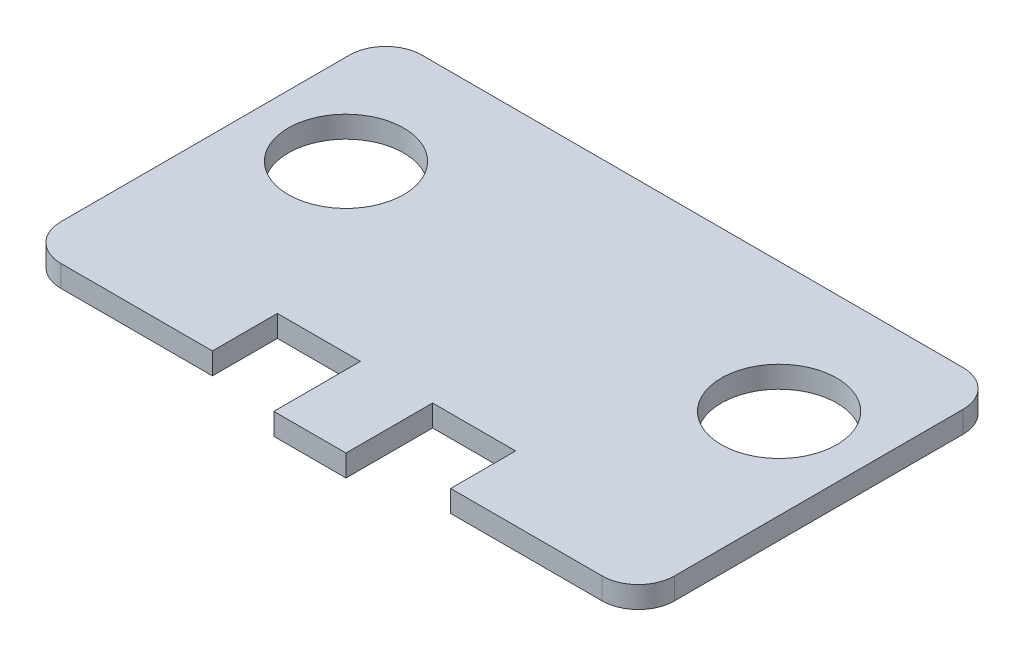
ISO-10303-21;
HEADER;
FILE_DESCRIPTION(('STEP AP214'),'2;1');
FILE_NAME('part.step','',(''),(''),'','','');
FILE_SCHEMA(('AUTOMOTIVE_DESIGN { 1 0 10303 214 1 1 1 1 }'));
ENDSEC;
DATA;
#1=APPLICATION_CONTEXT('core data for automotive mechanical design processes');
#2=APPLICATION_PROTOCOL_DEFINITION('international standard','automotive_design',2000,#1);
#3=PRODUCT_CONTEXT('',#1,'mechanical');
#4=PRODUCT('Part','Part','',(#3));
#5=PRODUCT_RELATED_PRODUCT_CATEGORY('part','',(#4));
#6=PRODUCT_DEFINITION_FORMATION('','',#4);
#7=PRODUCT_DEFINITION_CONTEXT('part definition',#1,'design');
#8=PRODUCT_DEFINITION('design','',#6,#7);
#9=PRODUCT_DEFINITION_SHAPE('','',#8);
#10=(LENGTH_UNIT() NAMED_UNIT(*) SI_UNIT(.MILLI.,.METRE.));
#11=(NAMED_UNIT(*) PLANE_ANGLE_UNIT() SI_UNIT($,.RADIAN.));
#12=(NAMED_UNIT(*) SI_UNIT($,.STERADIAN.) SOLID_ANGLE_UNIT());
#13=UNCERTAINTY_MEASURE_WITH_UNIT(LENGTH_MEASURE(1.E-05),#10,'distance_accuracy_value','');
#14=(GEOMETRIC_REPRESENTATION_CONTEXT(3) GLOBAL_UNCERTAINTY_ASSIGNED_CONTEXT((#13)) GLOBAL_UNIT_ASSIGNED_CONTEXT((#10,
#11,#12)) REPRESENTATION_CONTEXT('',''));
#15=CARTESIAN_POINT('',(0.,0.,0.));
#16=DIRECTION('',(0.,0.,1.));
#17=DIRECTION('',(1.,0.,0.));
#18=AXIS2_PLACEMENT_3D('',#15,#16,#17);
#19=CARTESIAN_POINT('',(0.,0.,16.));
#20=DIRECTION('',(0.,0.,-1.));
#21=DIRECTION('',(-1.,0.,0.));
#22=AXIS2_PLACEMENT_3D('',#19,#20,#21);
#23=PLANE('',#22);
#24=DIRECTION('',(0.,1.,0.));
#25=VECTOR('',#24,1.);
#26=CARTESIAN_POINT('',(5.,0.,16.));
#27=LINE('',#26,#25);
#28=CARTESIAN_POINT('',(5.,0.,16.));
#29=VERTEX_POINT('',#28);
#30=CARTESIAN_POINT('',(5.,3.,16.));
#31=VERTEX_POINT('',#30);
#32=EDGE_CURVE('E55',#29,#31,#27,.T.);
#33=ORIENTED_EDGE('',*,*,#32,.F.);
#34=DIRECTION('',(-1.,0.,0.));
#35=VECTOR('',#34,1.);
#36=CARTESIAN_POINT('',(0.,0.,16.));
#37=LINE('',#36,#35);
#38=CARTESIAN_POINT('',(16.5,0.,16.));
#39=VERTEX_POINT('',#38);
#40=EDGE_CURVE('E154',#39,#29,#37,.T.);
#41=ORIENTED_EDGE('',*,*,#40,.F.);
#42=DIRECTION('',(0.,1.,0.));
#43=VECTOR('',#42,1.);
#44=CARTESIAN_POINT('',(16.5,0.,16.));
#45=LINE('',#44,#43);
#46=CARTESIAN_POINT('',(16.5,3.,16.));
#47=VERTEX_POINT('',#46);
#48=EDGE_CURVE('E188',#39,#47,#45,.T.);
#49=ORIENTED_EDGE('',*,*,#48,.T.);
#50=DIRECTION('',(-1.,0.,0.));
#51=VECTOR('',#50,1.);
#52=CARTESIAN_POINT('',(0.,3.,16.));
#53=LINE('',#52,#51);
#54=EDGE_CURVE('E198',#47,#31,#53,.T.);
#55=ORIENTED_EDGE('',*,*,#54,.T.);
#56=EDGE_LOOP('',(#33,#41,#49,#55));
#57=FACE_BOUND('',#56,.T.);
#58=ADVANCED_FACE('F32',(#57),#23,.F.);
#59=CARTESIAN_POINT('',(-42.5,3.,25.));
#60=DIRECTION('',(0.,0.,-1.));
#61=DIRECTION('',(-1.,0.,0.));
#62=AXIS2_PLACEMENT_3D('',#59,#60,#61);
#63=PLANE('',#62);
#64=DIRECTION('',(0.,1.,0.));
#65=VECTOR('',#64,1.);
#66=CARTESIAN_POINT('',(16.5,0.,25.));
#67=LINE('',#66,#65);
#68=CARTESIAN_POINT('',(16.5,0.,25.));
#69=VERTEX_POINT('',#68);
#70=CARTESIAN_POINT('',(16.5,3.,25.));
#71=VERTEX_POINT('',#70);
#72=EDGE_CURVE('E185',#69,#71,#67,.T.);
#73=ORIENTED_EDGE('',*,*,#72,.F.);
#74=DIRECTION('',(1.,0.,0.));
#75=VECTOR('',#74,1.);
#76=CARTESIAN_POINT('',(-42.5,0.,25.));
#77=LINE('',#76,#75);
#78=CARTESIAN_POINT('',(37.5,0.,25.));
#79=VERTEX_POINT('',#78);
#80=EDGE_CURVE('E243',#69,#79,#77,.T.);
#81=ORIENTED_EDGE('',*,*,#80,.T.);
#82=DIRECTION('',(0.,-1.,0.));
#83=VECTOR('',#82,1.);
#84=CARTESIAN_POINT('',(37.5,3.,25.));
#85=LINE('',#84,#83);
#86=CARTESIAN_POINT('',(37.5,3.,25.));
#87=VERTEX_POINT('',#86);
#88=EDGE_CURVE('E11',#79,#87,#85,.F.);
#89=ORIENTED_EDGE('',*,*,#88,.T.);
#90=DIRECTION('',(1.,0.,0.));
#91=VECTOR('',#90,1.);
#92=CARTESIAN_POINT('',(-42.5,3.,25.));
#93=LINE('',#92,#91);
#94=EDGE_CURVE('E230',#71,#87,#93,.T.);
#95=ORIENTED_EDGE('',*,*,#94,.F.);
#96=EDGE_LOOP('',(#73,#81,#89,#95));
#97=FACE_BOUND('',#96,.T.);
#98=ADVANCED_FACE('F323',(#97),#63,.F.);
#99=CARTESIAN_POINT('',(0.,3.,0.));
#100=DIRECTION('',(0.,1.,0.));
#101=DIRECTION('',(0.,0.,1.));
#102=AXIS2_PLACEMENT_3D('',#99,#100,#101);
#103=PLANE('',#102);
#104=CARTESIAN_POINT('',(-30.,3.,-7.00000000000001));
#105=DIRECTION('',(0.,1.,0.));
#106=DIRECTION('',(0.,0.,1.));
#107=AXIS2_PLACEMENT_3D('',#104,#105,#106);
#108=CIRCLE('',#107,8.);
#109=CARTESIAN_POINT('',(-30.,3.,0.999999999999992));
#110=VERTEX_POINT('',#109);
#111=EDGE_CURVE('E211',#110,#110,#108,.T.);
#112=ORIENTED_EDGE('',*,*,#111,.F.);
#113=EDGE_LOOP('',(#112));
#114=FACE_BOUND('',#113,.T.);
#115=CARTESIAN_POINT('',(30.,3.,-7.00000000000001));
#116=DIRECTION('',(0.,1.,0.));
#117=DIRECTION('',(0.,0.,1.));
#118=AXIS2_PLACEMENT_3D('',#115,#116,#117);
#119=CIRCLE('',#118,8.);
#120=CARTESIAN_POINT('',(30.,3.,0.999999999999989));
#121=VERTEX_POINT('',#120);
#122=EDGE_CURVE('E205',#121,#121,#119,.T.);
#123=ORIENTED_EDGE('',*,*,#122,.F.);
#124=EDGE_LOOP('',(#123));
#125=FACE_BOUND('',#124,.T.);
#126=ORIENTED_EDGE('',*,*,#54,.F.);
#127=DIRECTION('',(0.,0.,1.));
#128=VECTOR('',#127,1.);
#129=CARTESIAN_POINT('',(16.5,3.,25.));
#130=LINE('',#129,#128);
#131=EDGE_CURVE('E182',#47,#71,#130,.T.);
#132=ORIENTED_EDGE('',*,*,#131,.T.);
#133=ORIENTED_EDGE('',*,*,#94,.T.);
#134=CARTESIAN_POINT('',(37.5,3.,20.));
#135=DIRECTION('',(0.,1.,0.));
#136=DIRECTION('',(0.,0.,1.));
#137=AXIS2_PLACEMENT_3D('',#134,#135,#136);
#138=CIRCLE('',#137,5.);
#139=CARTESIAN_POINT('',(42.5,3.,20.));
#140=VERTEX_POINT('',#139);
#141=EDGE_CURVE('E266',#87,#140,#138,.T.);
#142=ORIENTED_EDGE('',*,*,#141,.T.);
#143=DIRECTION('',(0.,0.,-1.));
#144=VECTOR('',#143,1.);
#145=CARTESIAN_POINT('',(42.5,3.,-25.));
#146=LINE('',#145,#144);
#147=CARTESIAN_POINT('',(42.5,3.,-20.));
#148=VERTEX_POINT('',#147);
#149=EDGE_CURVE('E220',#140,#148,#146,.T.);
#150=ORIENTED_EDGE('',*,*,#149,.T.);
#151=CARTESIAN_POINT('',(37.5,3.,-20.));
#152=DIRECTION('',(0.,1.,0.));
#153=DIRECTION('',(0.,0.,1.));
#154=AXIS2_PLACEMENT_3D('',#151,#152,#153);
#155=CIRCLE('',#154,5.);
#156=CARTESIAN_POINT('',(37.5,3.,-25.));
#157=VERTEX_POINT('',#156);
#158=EDGE_CURVE('E268',#148,#157,#155,.T.);
#159=ORIENTED_EDGE('',*,*,#158,.T.);
#160=DIRECTION('',(-1.,0.,0.));
#161=VECTOR('',#160,1.);
#162=CARTESIAN_POINT('',(-42.5,3.,-25.));
#163=LINE('',#162,#161);
#164=CARTESIAN_POINT('',(-37.5,3.,-25.));
#165=VERTEX_POINT('',#164);
#166=EDGE_CURVE('E223',#157,#165,#163,.T.);
#167=ORIENTED_EDGE('',*,*,#166,.T.);
#168=CARTESIAN_POINT('',(-37.5,3.,-20.));
#169=DIRECTION('',(0.,1.,0.));
#170=DIRECTION('',(0.,0.,1.));
#171=AXIS2_PLACEMENT_3D('',#168,#169,#170);
#172=CIRCLE('',#171,5.);
#173=CARTESIAN_POINT('',(-42.5,3.,-20.));
#174=VERTEX_POINT('',#173);
#175=EDGE_CURVE('E270',#165,#174,#172,.T.);
#176=ORIENTED_EDGE('',*,*,#175,.T.);
#177=DIRECTION('',(0.,0.,1.));
#178=VECTOR('',#177,1.);
#179=CARTESIAN_POINT('',(-42.5,3.,-25.));
#180=LINE('',#179,#178);
#181=CARTESIAN_POINT('',(-42.5,3.,20.));
#182=VERTEX_POINT('',#181);
#183=EDGE_CURVE('E227',#174,#182,#180,.T.);
#184=ORIENTED_EDGE('',*,*,#183,.T.);
#185=CARTESIAN_POINT('',(-37.5,3.,20.));
#186=DIRECTION('',(0.,1.,0.));
#187=DIRECTION('',(0.,0.,1.));
#188=AXIS2_PLACEMENT_3D('',#185,#186,#187);
#189=CIRCLE('',#188,5.);
#190=CARTESIAN_POINT('',(-37.5,3.,25.));
#191=VERTEX_POINT('',#190);
#192=EDGE_CURVE('E264',#182,#191,#189,.T.);
#193=ORIENTED_EDGE('',*,*,#192,.T.);
#194=CARTESIAN_POINT('',(-16.5,3.,25.));
#195=VERTEX_POINT('',#194);
#196=EDGE_CURVE('E231',#191,#195,#93,.T.);
#197=ORIENTED_EDGE('',*,*,#196,.T.);
#198=DIRECTION('',(0.,0.,1.));
#199=VECTOR('',#198,1.);
#200=CARTESIAN_POINT('',(-16.5,3.,25.));
#201=LINE('',#200,#199);
#202=CARTESIAN_POINT('',(-16.5,3.,16.));
#203=VERTEX_POINT('',#202);
#204=EDGE_CURVE('E200',#203,#195,#201,.T.);
#205=ORIENTED_EDGE('',*,*,#204,.F.);
#206=CARTESIAN_POINT('',(-5.,3.,16.));
#207=VERTEX_POINT('',#206);
#208=EDGE_CURVE('E191',#207,#203,#53,.T.);
#209=ORIENTED_EDGE('',*,*,#208,.F.);
#210=DIRECTION('',(0.,0.,1.));
#211=VECTOR('',#210,1.);
#212=CARTESIAN_POINT('',(-5.,3.,16.));
#213=LINE('',#212,#211);
#214=CARTESIAN_POINT('',(-5.,3.,28.));
#215=VERTEX_POINT('',#214);
#216=EDGE_CURVE('E156',#207,#215,#213,.T.);
#217=ORIENTED_EDGE('',*,*,#216,.T.);
#218=DIRECTION('',(1.,0.,0.));
#219=VECTOR('',#218,1.);
#220=CARTESIAN_POINT('',(-5.,3.,28.));
#221=LINE('',#220,#219);
#222=CARTESIAN_POINT('',(5.,3.,28.));
#223=VERTEX_POINT('',#222);
#224=EDGE_CURVE('E175',#215,#223,#221,.T.);
#225=ORIENTED_EDGE('',*,*,#224,.T.);
#226=DIRECTION('',(0.,0.,1.));
#227=VECTOR('',#226,1.);
#228=CARTESIAN_POINT('',(5.,3.,16.));
#229=LINE('',#228,#227);
#230=EDGE_CURVE('E162',#31,#223,#229,.T.);
#231=ORIENTED_EDGE('',*,*,#230,.F.);
#232=EDGE_LOOP('',(#126,#132,#133,#142,#150,#159,#167,#176,#184,#193,#197,#205,#209,#217,#225,#231));
#233=FACE_BOUND('',#232,.T.);
#234=ADVANCED_FACE('F292',(#114,#125,#233),#103,.T.);
#235=CARTESIAN_POINT('',(0.,0.,0.));
#236=DIRECTION('',(0.,1.,0.));
#237=DIRECTION('',(0.,0.,1.));
#238=AXIS2_PLACEMENT_3D('',#235,#236,#237);
#239=PLANE('',#238);
#240=CARTESIAN_POINT('',(-30.,0.,-7.00000000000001));
#241=DIRECTION('',(0.,1.,0.));
#242=DIRECTION('',(0.,0.,1.));
#243=AXIS2_PLACEMENT_3D('',#240,#241,#242);
#244=CIRCLE('',#243,8.);
#245=CARTESIAN_POINT('',(-30.,0.,0.999999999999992));
#246=VERTEX_POINT('',#245);
#247=EDGE_CURVE('E214',#246,#246,#244,.T.);
#248=ORIENTED_EDGE('',*,*,#247,.T.);
#249=EDGE_LOOP('',(#248));
#250=FACE_BOUND('',#249,.T.);
#251=CARTESIAN_POINT('',(30.,0.,-7.00000000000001));
#252=DIRECTION('',(0.,1.,0.));
#253=DIRECTION('',(0.,0.,1.));
#254=AXIS2_PLACEMENT_3D('',#251,#252,#253);
#255=CIRCLE('',#254,8.);
#256=CARTESIAN_POINT('',(30.,0.,0.999999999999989));
#257=VERTEX_POINT('',#256);
#258=EDGE_CURVE('E208',#257,#257,#255,.T.);
#259=ORIENTED_EDGE('',*,*,#258,.T.);
#260=EDGE_LOOP('',(#259));
#261=FACE_BOUND('',#260,.T.);
#262=DIRECTION('',(0.,0.,1.));
#263=VECTOR('',#262,1.);
#264=CARTESIAN_POINT('',(16.5,0.,25.));
#265=LINE('',#264,#263);
#266=EDGE_CURVE('E183',#39,#69,#265,.T.);
#267=ORIENTED_EDGE('',*,*,#266,.F.);
#268=ORIENTED_EDGE('',*,*,#40,.T.);
#269=DIRECTION('',(0.,0.,1.));
#270=VECTOR('',#269,1.);
#271=CARTESIAN_POINT('',(5.,0.,16.));
#272=LINE('',#271,#270);
#273=CARTESIAN_POINT('',(5.,0.,28.));
#274=VERTEX_POINT('',#273);
#275=EDGE_CURVE('E146',#29,#274,#272,.T.);
#276=ORIENTED_EDGE('',*,*,#275,.T.);
#277=DIRECTION('',(1.,0.,0.));
#278=VECTOR('',#277,1.);
#279=CARTESIAN_POINT('',(-5.,0.,28.));
#280=LINE('',#279,#278);
#281=CARTESIAN_POINT('',(-5.,0.,28.));
#282=VERTEX_POINT('',#281);
#283=EDGE_CURVE('E152',#282,#274,#280,.T.);
#284=ORIENTED_EDGE('',*,*,#283,.F.);
#285=DIRECTION('',(0.,0.,1.));
#286=VECTOR('',#285,1.);
#287=CARTESIAN_POINT('',(-5.,0.,16.));
#288=LINE('',#287,#286);
#289=CARTESIAN_POINT('',(-5.,0.,16.));
#290=VERTEX_POINT('',#289);
#291=EDGE_CURVE('E169',#290,#282,#288,.T.);
#292=ORIENTED_EDGE('',*,*,#291,.F.);
#293=CARTESIAN_POINT('',(-16.5,0.,16.));
#294=VERTEX_POINT('',#293);
#295=EDGE_CURVE('E47',#290,#294,#37,.T.);
#296=ORIENTED_EDGE('',*,*,#295,.T.);
#297=DIRECTION('',(0.,0.,1.));
#298=VECTOR('',#297,1.);
#299=CARTESIAN_POINT('',(-16.5,0.,25.));
#300=LINE('',#299,#298);
#301=CARTESIAN_POINT('',(-16.5,0.,25.));
#302=VERTEX_POINT('',#301);
#303=EDGE_CURVE('E194',#294,#302,#300,.T.);
#304=ORIENTED_EDGE('',*,*,#303,.T.);
#305=CARTESIAN_POINT('',(-37.5,0.,25.));
#306=VERTEX_POINT('',#305);
#307=EDGE_CURVE('E224',#306,#302,#77,.T.);
#308=ORIENTED_EDGE('',*,*,#307,.F.);
#309=CARTESIAN_POINT('',(-37.5,0.,20.));
#310=DIRECTION('',(0.,1.,0.));
#311=DIRECTION('',(0.,0.,1.));
#312=AXIS2_PLACEMENT_3D('',#309,#310,#311);
#313=CIRCLE('',#312,5.);
#314=CARTESIAN_POINT('',(-42.5,0.,20.));
#315=VERTEX_POINT('',#314);
#316=EDGE_CURVE('E250',#306,#315,#313,.F.);
#317=ORIENTED_EDGE('',*,*,#316,.T.);
#318=DIRECTION('',(0.,0.,1.));
#319=VECTOR('',#318,1.);
#320=CARTESIAN_POINT('',(-42.5,0.,-25.));
#321=LINE('',#320,#319);
#322=CARTESIAN_POINT('',(-42.5,0.,-20.));
#323=VERTEX_POINT('',#322);
#324=EDGE_CURVE('E240',#323,#315,#321,.T.);
#325=ORIENTED_EDGE('',*,*,#324,.F.);
#326=CARTESIAN_POINT('',(-37.5,0.,-20.));
#327=DIRECTION('',(0.,1.,0.));
#328=DIRECTION('',(0.,0.,1.));
#329=AXIS2_PLACEMENT_3D('',#326,#327,#328);
#330=CIRCLE('',#329,5.);
#331=CARTESIAN_POINT('',(-37.5,0.,-25.));
#332=VERTEX_POINT('',#331);
#333=EDGE_CURVE('E257',#323,#332,#330,.F.);
#334=ORIENTED_EDGE('',*,*,#333,.T.);
#335=DIRECTION('',(-1.,0.,0.));
#336=VECTOR('',#335,1.);
#337=CARTESIAN_POINT('',(-42.5,0.,-25.));
#338=LINE('',#337,#336);
#339=CARTESIAN_POINT('',(37.5,0.,-25.));
#340=VERTEX_POINT('',#339);
#341=EDGE_CURVE('E237',#340,#332,#338,.T.);
#342=ORIENTED_EDGE('',*,*,#341,.F.);
#343=CARTESIAN_POINT('',(37.5,0.,-20.));
#344=DIRECTION('',(0.,1.,0.));
#345=DIRECTION('',(0.,0.,1.));
#346=AXIS2_PLACEMENT_3D('',#343,#344,#345);
#347=CIRCLE('',#346,5.);
#348=CARTESIAN_POINT('',(42.5,0.,-20.));
#349=VERTEX_POINT('',#348);
#350=EDGE_CURVE('E255',#340,#349,#347,.F.);
#351=ORIENTED_EDGE('',*,*,#350,.T.);
#352=DIRECTION('',(0.,0.,-1.));
#353=VECTOR('',#352,1.);
#354=CARTESIAN_POINT('',(42.5,0.,-25.));
#355=LINE('',#354,#353);
#356=CARTESIAN_POINT('',(42.5,0.,20.));
#357=VERTEX_POINT('',#356);
#358=EDGE_CURVE('E217',#357,#349,#355,.T.);
#359=ORIENTED_EDGE('',*,*,#358,.F.);
#360=CARTESIAN_POINT('',(37.5,0.,20.));
#361=DIRECTION('',(0.,1.,0.));
#362=DIRECTION('',(0.,0.,1.));
#363=AXIS2_PLACEMENT_3D('',#360,#361,#362);
#364=CIRCLE('',#363,5.);
#365=EDGE_CURVE('E252',#357,#79,#364,.F.);
#366=ORIENTED_EDGE('',*,*,#365,.T.);
#367=ORIENTED_EDGE('',*,*,#80,.F.);
#368=EDGE_LOOP('',(#267,#268,#276,#284,#292,#296,#304,#308,#317,#325,#334,#342,#351,#359,#366,#367));
#369=FACE_BOUND('',#368,.T.);
#370=ADVANCED_FACE('F149',(#250,#261,#369),#239,.F.);
#371=CARTESIAN_POINT('',(42.5,3.,-25.));
#372=DIRECTION('',(-1.,0.,0.));
#373=DIRECTION('',(0.,0.,1.));
#374=AXIS2_PLACEMENT_3D('',#371,#372,#373);
#375=PLANE('',#374);
#376=ORIENTED_EDGE('',*,*,#358,.T.);
#377=DIRECTION('',(0.,-1.,0.));
#378=VECTOR('',#377,1.);
#379=CARTESIAN_POINT('',(42.5,3.,-20.));
#380=LINE('',#379,#378);
#381=EDGE_CURVE('E275',#349,#148,#380,.F.);
#382=ORIENTED_EDGE('',*,*,#381,.T.);
#383=ORIENTED_EDGE('',*,*,#149,.F.);
#384=DIRECTION('',(0.,-1.,0.));
#385=VECTOR('',#384,1.);
#386=CARTESIAN_POINT('',(42.5,3.,20.));
#387=LINE('',#386,#385);
#388=EDGE_CURVE('E272',#140,#357,#387,.T.);
#389=ORIENTED_EDGE('',*,*,#388,.T.);
#390=EDGE_LOOP('',(#376,#382,#383,#389));
#391=FACE_BOUND('',#390,.T.);
#392=ADVANCED_FACE('F313',(#391),#375,.F.);
#393=CARTESIAN_POINT('',(-42.5,3.,-25.));
#394=DIRECTION('',(0.,0.,1.));
#395=DIRECTION('',(1.,0.,0.));
#396=AXIS2_PLACEMENT_3D('',#393,#394,#395);
#397=PLANE('',#396);
#398=ORIENTED_EDGE('',*,*,#341,.T.);
#399=DIRECTION('',(0.,-1.,0.));
#400=VECTOR('',#399,1.);
#401=CARTESIAN_POINT('',(-37.5,3.,-25.));
#402=LINE('',#401,#400);
#403=EDGE_CURVE('E262',#332,#165,#402,.F.);
#404=ORIENTED_EDGE('',*,*,#403,.T.);
#405=ORIENTED_EDGE('',*,*,#166,.F.);
#406=DIRECTION('',(0.,-1.,0.));
#407=VECTOR('',#406,1.);
#408=CARTESIAN_POINT('',(37.5,3.,-25.));
#409=LINE('',#408,#407);
#410=EDGE_CURVE('E259',#157,#340,#409,.T.);
#411=ORIENTED_EDGE('',*,*,#410,.T.);
#412=EDGE_LOOP('',(#398,#404,#405,#411));
#413=FACE_BOUND('',#412,.T.);
#414=ADVANCED_FACE('F302',(#413),#397,.F.);
#415=CARTESIAN_POINT('',(-42.5,3.,-25.));
#416=DIRECTION('',(1.,0.,0.));
#417=DIRECTION('',(0.,0.,-1.));
#418=AXIS2_PLACEMENT_3D('',#415,#416,#417);
#419=PLANE('',#418);
#420=ORIENTED_EDGE('',*,*,#183,.F.);
#421=DIRECTION('',(0.,-1.,0.));
#422=VECTOR('',#421,1.);
#423=CARTESIAN_POINT('',(-42.5,3.,-20.));
#424=LINE('',#423,#422);
#425=EDGE_CURVE('E247',#174,#323,#424,.T.);
#426=ORIENTED_EDGE('',*,*,#425,.T.);
#427=ORIENTED_EDGE('',*,*,#324,.T.);
#428=DIRECTION('',(0.,-1.,0.));
#429=VECTOR('',#428,1.);
#430=CARTESIAN_POINT('',(-42.5,3.,20.));
#431=LINE('',#430,#429);
#432=EDGE_CURVE('E234',#315,#182,#431,.F.);
#433=ORIENTED_EDGE('',*,*,#432,.T.);
#434=EDGE_LOOP('',(#420,#426,#427,#433));
#435=FACE_BOUND('',#434,.T.);
#436=ADVANCED_FACE('F296',(#435),#419,.F.);
#437=ORIENTED_EDGE('',*,*,#307,.T.);
#438=DIRECTION('',(0.,1.,0.));
#439=VECTOR('',#438,1.);
#440=CARTESIAN_POINT('',(-16.5,0.,25.));
#441=LINE('',#440,#439);
#442=EDGE_CURVE('E202',#302,#195,#441,.T.);
#443=ORIENTED_EDGE('',*,*,#442,.T.);
#444=ORIENTED_EDGE('',*,*,#196,.F.);
#445=DIRECTION('',(0.,-1.,0.));
#446=VECTOR('',#445,1.);
#447=CARTESIAN_POINT('',(-37.5,3.,25.));
#448=LINE('',#447,#446);
#449=EDGE_CURVE('E40',#191,#306,#448,.T.);
#450=ORIENTED_EDGE('',*,*,#449,.T.);
#451=EDGE_LOOP('',(#437,#443,#444,#450));
#452=FACE_BOUND('',#451,.T.);
#453=ADVANCED_FACE('F281',(#452),#63,.F.);
#454=CARTESIAN_POINT('',(-37.5,3.,-20.));
#455=DIRECTION('',(0.,-1.,0.));
#456=DIRECTION('',(0.,0.,-1.));
#457=AXIS2_PLACEMENT_3D('',#454,#455,#456);
#458=CYLINDRICAL_SURFACE('',#457,5.);
#459=ORIENTED_EDGE('',*,*,#175,.F.);
#460=ORIENTED_EDGE('',*,*,#403,.F.);
#461=ORIENTED_EDGE('',*,*,#333,.F.);
#462=ORIENTED_EDGE('',*,*,#425,.F.);
#463=EDGE_LOOP('',(#459,#460,#461,#462));
#464=FACE_BOUND('',#463,.T.);
#465=ADVANCED_FACE('F306',(#464),#458,.T.);
#466=CARTESIAN_POINT('',(37.5,3.,-20.));
#467=DIRECTION('',(0.,-1.,0.));
#468=DIRECTION('',(0.,0.,-1.));
#469=AXIS2_PLACEMENT_3D('',#466,#467,#468);
#470=CYLINDRICAL_SURFACE('',#469,5.);
#471=ORIENTED_EDGE('',*,*,#158,.F.);
#472=ORIENTED_EDGE('',*,*,#381,.F.);
#473=ORIENTED_EDGE('',*,*,#350,.F.);
#474=ORIENTED_EDGE('',*,*,#410,.F.);
#475=EDGE_LOOP('',(#471,#472,#473,#474));
#476=FACE_BOUND('',#475,.T.);
#477=ADVANCED_FACE('F309',(#476),#470,.T.);
#478=CARTESIAN_POINT('',(37.5,3.,20.));
#479=DIRECTION('',(0.,-1.,0.));
#480=DIRECTION('',(0.,0.,-1.));
#481=AXIS2_PLACEMENT_3D('',#478,#479,#480);
#482=CYLINDRICAL_SURFACE('',#481,5.);
#483=ORIENTED_EDGE('',*,*,#141,.F.);
#484=ORIENTED_EDGE('',*,*,#88,.F.);
#485=ORIENTED_EDGE('',*,*,#365,.F.);
#486=ORIENTED_EDGE('',*,*,#388,.F.);
#487=EDGE_LOOP('',(#483,#484,#485,#486));
#488=FACE_BOUND('',#487,.T.);
#489=ADVANCED_FACE('F318',(#488),#482,.T.);
#490=CARTESIAN_POINT('',(-37.5,3.,20.));
#491=DIRECTION('',(0.,-1.,0.));
#492=DIRECTION('',(0.,0.,-1.));
#493=AXIS2_PLACEMENT_3D('',#490,#491,#492);
#494=CYLINDRICAL_SURFACE('',#493,5.);
#495=ORIENTED_EDGE('',*,*,#192,.F.);
#496=ORIENTED_EDGE('',*,*,#432,.F.);
#497=ORIENTED_EDGE('',*,*,#316,.F.);
#498=ORIENTED_EDGE('',*,*,#449,.F.);
#499=EDGE_LOOP('',(#495,#496,#497,#498));
#500=FACE_BOUND('',#499,.T.);
#501=ADVANCED_FACE('F34',(#500),#494,.T.);
#502=CARTESIAN_POINT('',(-30.,0.,-7.00000000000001));
#503=DIRECTION('',(0.,1.,0.));
#504=DIRECTION('',(0.,0.,1.));
#505=AXIS2_PLACEMENT_3D('',#502,#503,#504);
#506=CYLINDRICAL_SURFACE('',#505,8.);
#507=ORIENTED_EDGE('',*,*,#247,.F.);
#508=EDGE_LOOP('',(#507));
#509=FACE_BOUND('',#508,.T.);
#510=ORIENTED_EDGE('',*,*,#111,.T.);
#511=EDGE_LOOP('',(#510));
#512=FACE_BOUND('',#511,.T.);
#513=ADVANCED_FACE('F347',(#509,#512),#506,.F.);
#514=CARTESIAN_POINT('',(30.,0.,-7.00000000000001));
#515=DIRECTION('',(0.,1.,0.));
#516=DIRECTION('',(0.,0.,1.));
#517=AXIS2_PLACEMENT_3D('',#514,#515,#516);
#518=CYLINDRICAL_SURFACE('',#517,8.);
#519=ORIENTED_EDGE('',*,*,#258,.F.);
#520=EDGE_LOOP('',(#519));
#521=FACE_BOUND('',#520,.T.);
#522=ORIENTED_EDGE('',*,*,#122,.T.);
#523=EDGE_LOOP('',(#522));
#524=FACE_BOUND('',#523,.T.);
#525=ADVANCED_FACE('F343',(#521,#524),#518,.F.);
#526=CARTESIAN_POINT('',(-16.5,0.,25.));
#527=DIRECTION('',(-1.,0.,0.));
#528=DIRECTION('',(0.,0.,1.));
#529=AXIS2_PLACEMENT_3D('',#526,#527,#528);
#530=PLANE('',#529);
#531=ORIENTED_EDGE('',*,*,#204,.T.);
#532=ORIENTED_EDGE('',*,*,#442,.F.);
#533=ORIENTED_EDGE('',*,*,#303,.F.);
#534=DIRECTION('',(0.,1.,0.));
#535=VECTOR('',#534,1.);
#536=CARTESIAN_POINT('',(-16.5,0.,16.));
#537=LINE('',#536,#535);
#538=EDGE_CURVE('E197',#294,#203,#537,.T.);
#539=ORIENTED_EDGE('',*,*,#538,.T.);
#540=EDGE_LOOP('',(#531,#532,#533,#539));
#541=FACE_BOUND('',#540,.T.);
#542=ADVANCED_FACE('F287',(#541),#530,.F.);
#543=ORIENTED_EDGE('',*,*,#295,.F.);
#544=DIRECTION('',(0.,1.,0.));
#545=VECTOR('',#544,1.);
#546=CARTESIAN_POINT('',(-5.,0.,16.));
#547=LINE('',#546,#545);
#548=EDGE_CURVE('E171',#290,#207,#547,.T.);
#549=ORIENTED_EDGE('',*,*,#548,.T.);
#550=ORIENTED_EDGE('',*,*,#208,.T.);
#551=ORIENTED_EDGE('',*,*,#538,.F.);
#552=EDGE_LOOP('',(#543,#549,#550,#551));
#553=FACE_BOUND('',#552,.T.);
#554=ADVANCED_FACE('F289',(#553),#23,.F.);
#555=CARTESIAN_POINT('',(16.5,0.,25.));
#556=DIRECTION('',(-1.,0.,0.));
#557=DIRECTION('',(0.,0.,1.));
#558=AXIS2_PLACEMENT_3D('',#555,#556,#557);
#559=PLANE('',#558);
#560=ORIENTED_EDGE('',*,*,#131,.F.);
#561=ORIENTED_EDGE('',*,*,#48,.F.);
#562=ORIENTED_EDGE('',*,*,#266,.T.);
#563=ORIENTED_EDGE('',*,*,#72,.T.);
#564=EDGE_LOOP('',(#560,#561,#562,#563));
#565=FACE_BOUND('',#564,.T.);
#566=ADVANCED_FACE('F327',(#565),#559,.T.);
#567=CARTESIAN_POINT('',(5.,0.,16.));
#568=DIRECTION('',(-1.,0.,0.));
#569=DIRECTION('',(0.,0.,1.));
#570=AXIS2_PLACEMENT_3D('',#567,#568,#569);
#571=PLANE('',#570);
#572=ORIENTED_EDGE('',*,*,#230,.T.);
#573=DIRECTION('',(0.,1.,0.));
#574=VECTOR('',#573,1.);
#575=CARTESIAN_POINT('',(5.,0.,28.));
#576=LINE('',#575,#574);
#577=EDGE_CURVE('E159',#274,#223,#576,.T.);
#578=ORIENTED_EDGE('',*,*,#577,.F.);
#579=ORIENTED_EDGE('',*,*,#275,.F.);
#580=ORIENTED_EDGE('',*,*,#32,.T.);
#581=EDGE_LOOP('',(#572,#578,#579,#580));
#582=FACE_BOUND('',#581,.T.);
#583=ADVANCED_FACE('F160',(#582),#571,.F.);
#584=CARTESIAN_POINT('',(-5.,0.,28.));
#585=DIRECTION('',(0.,0.,1.));
#586=DIRECTION('',(1.,0.,0.));
#587=AXIS2_PLACEMENT_3D('',#584,#585,#586);
#588=PLANE('',#587);
#589=ORIENTED_EDGE('',*,*,#224,.F.);
#590=DIRECTION('',(0.,1.,0.));
#591=VECTOR('',#590,1.);
#592=CARTESIAN_POINT('',(-5.,0.,28.));
#593=LINE('',#592,#591);
#594=EDGE_CURVE('E166',#282,#215,#593,.T.);
#595=ORIENTED_EDGE('',*,*,#594,.F.);
#596=ORIENTED_EDGE('',*,*,#283,.T.);
#597=ORIENTED_EDGE('',*,*,#577,.T.);
#598=EDGE_LOOP('',(#589,#595,#596,#597));
#599=FACE_BOUND('',#598,.T.);
#600=ADVANCED_FACE('F168',(#599),#588,.T.);
#601=CARTESIAN_POINT('',(-5.,0.,16.));
#602=DIRECTION('',(-1.,0.,0.));
#603=DIRECTION('',(0.,0.,1.));
#604=AXIS2_PLACEMENT_3D('',#601,#602,#603);
#605=PLANE('',#604);
#606=ORIENTED_EDGE('',*,*,#216,.F.);
#607=ORIENTED_EDGE('',*,*,#548,.F.);
#608=ORIENTED_EDGE('',*,*,#291,.T.);
#609=ORIENTED_EDGE('',*,*,#594,.T.);
#610=EDGE_LOOP('',(#606,#607,#608,#609));
#611=FACE_BOUND('',#610,.T.);
#612=ADVANCED_FACE('F354',(#611),#605,.T.);
#613=CLOSED_SHELL('',(#58,#98,#234,#370,#392,#414,#436,#453,#465,#477,#489,#501,#513,#525,#542,
#554,#566,#583,#600,#612));
#614=MANIFOLD_SOLID_BREP('B2',#613);
#615=ADVANCED_BREP_SHAPE_REPRESENTATION('',(#18,#614),#14);
#616=SHAPE_DEFINITION_REPRESENTATION(#9,#615);
ENDSEC;
END-ISO-10303-21;
